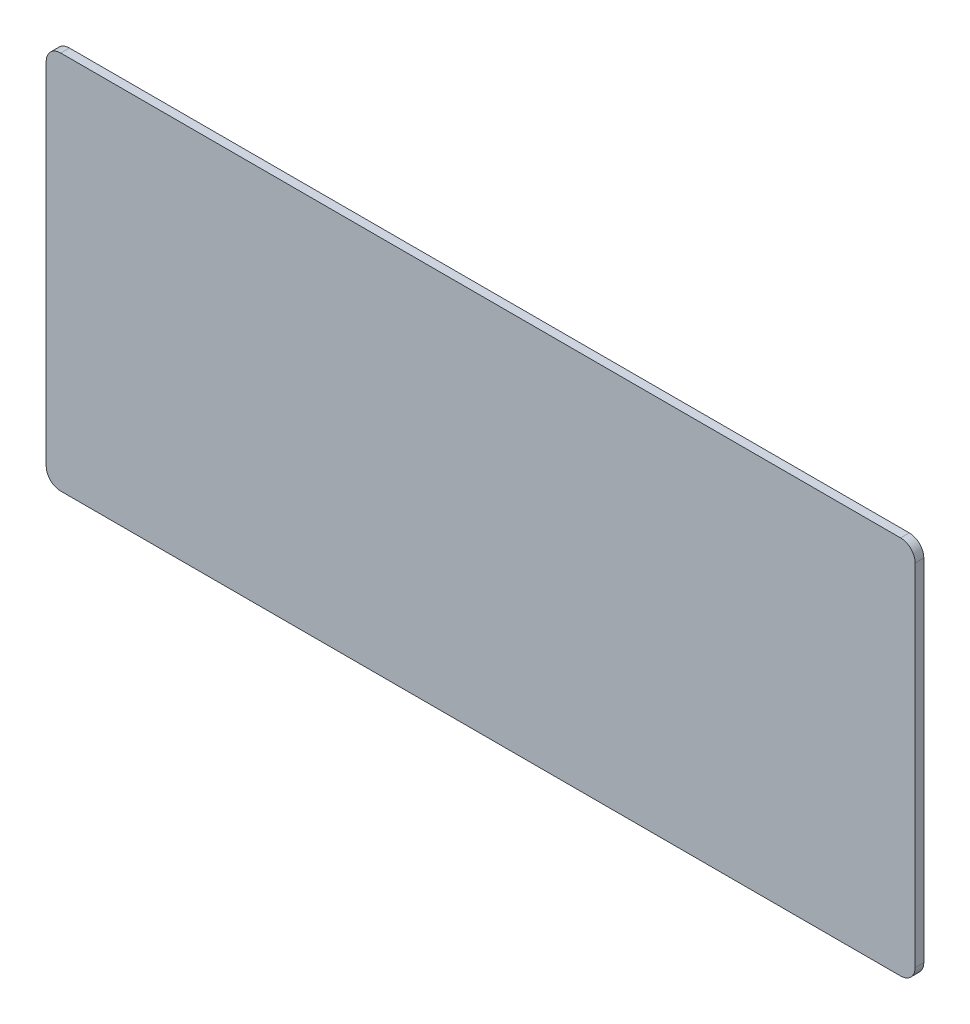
ISO-10303-21;
HEADER;
FILE_DESCRIPTION(('STEP AP214'),'2;1');
FILE_NAME('part.step','',(''),(''),'','','');
FILE_SCHEMA(('AUTOMOTIVE_DESIGN { 1 0 10303 214 1 1 1 1 }'));
ENDSEC;
DATA;
#1=APPLICATION_CONTEXT('core data for automotive mechanical design processes');
#2=APPLICATION_PROTOCOL_DEFINITION('international standard','automotive_design',2000,#1);
#3=PRODUCT_CONTEXT('',#1,'mechanical');
#4=PRODUCT('Part','Part','',(#3));
#5=PRODUCT_RELATED_PRODUCT_CATEGORY('part','',(#4));
#6=PRODUCT_DEFINITION_FORMATION('','',#4);
#7=PRODUCT_DEFINITION_CONTEXT('part definition',#1,'design');
#8=PRODUCT_DEFINITION('design','',#6,#7);
#9=PRODUCT_DEFINITION_SHAPE('','',#8);
#10=(LENGTH_UNIT() NAMED_UNIT(*) SI_UNIT(.MILLI.,.METRE.));
#11=(NAMED_UNIT(*) PLANE_ANGLE_UNIT() SI_UNIT($,.RADIAN.));
#12=(NAMED_UNIT(*) SI_UNIT($,.STERADIAN.) SOLID_ANGLE_UNIT());
#13=UNCERTAINTY_MEASURE_WITH_UNIT(LENGTH_MEASURE(1.E-05),#10,'distance_accuracy_value','');
#14=(GEOMETRIC_REPRESENTATION_CONTEXT(3) GLOBAL_UNCERTAINTY_ASSIGNED_CONTEXT((#13)) GLOBAL_UNIT_ASSIGNED_CONTEXT((#10,
#11,#12)) REPRESENTATION_CONTEXT('',''));
#15=CARTESIAN_POINT('',(0.,0.,0.));
#16=DIRECTION('',(0.,0.,1.));
#17=DIRECTION('',(1.,0.,0.));
#18=AXIS2_PLACEMENT_3D('',#15,#16,#17);
#19=CARTESIAN_POINT('',(0.,0.,6.));
#20=DIRECTION('',(1.,0.,0.));
#21=DIRECTION('',(0.,1.,0.));
#22=AXIS2_PLACEMENT_3D('',#19,#20,#21);
#23=PLANE('',#22);
#24=DIRECTION('',(0.,-1.,0.));
#25=VECTOR('',#24,1.);
#26=CARTESIAN_POINT('',(0.,0.,0.));
#27=LINE('',#26,#25);
#28=CARTESIAN_POINT('',(0.,-10.,0.));
#29=VERTEX_POINT('',#28);
#30=CARTESIAN_POINT('',(1.11910480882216E-13,-252.,0.));
#31=VERTEX_POINT('',#30);
#32=EDGE_CURVE('E136',#29,#31,#27,.T.);
#33=ORIENTED_EDGE('',*,*,#32,.T.);
#34=DIRECTION('',(0.,0.,-1.));
#35=VECTOR('',#34,1.);
#36=CARTESIAN_POINT('',(1.11910480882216E-13,-252.,6.));
#37=LINE('',#36,#35);
#38=CARTESIAN_POINT('',(1.11910480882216E-13,-252.,6.));
#39=VERTEX_POINT('',#38);
#40=EDGE_CURVE('E111',#31,#39,#37,.F.);
#41=ORIENTED_EDGE('',*,*,#40,.T.);
#42=DIRECTION('',(0.,-1.,0.));
#43=VECTOR('',#42,1.);
#44=CARTESIAN_POINT('',(0.,0.,6.));
#45=LINE('',#44,#43);
#46=CARTESIAN_POINT('',(0.,-10.,6.));
#47=VERTEX_POINT('',#46);
#48=EDGE_CURVE('E139',#47,#39,#45,.T.);
#49=ORIENTED_EDGE('',*,*,#48,.F.);
#50=DIRECTION('',(0.,0.,-1.));
#51=VECTOR('',#50,1.);
#52=CARTESIAN_POINT('',(0.,-10.,6.));
#53=LINE('',#52,#51);
#54=EDGE_CURVE('E116',#47,#29,#53,.T.);
#55=ORIENTED_EDGE('',*,*,#54,.T.);
#56=EDGE_LOOP('',(#33,#41,#49,#55));
#57=FACE_BOUND('',#56,.T.);
#58=ADVANCED_FACE('F40',(#57),#23,.F.);
#59=CARTESIAN_POINT('',(600.,0.,6.));
#60=DIRECTION('',(-1.,0.,0.));
#61=DIRECTION('',(0.,-1.,0.));
#62=AXIS2_PLACEMENT_3D('',#59,#60,#61);
#63=PLANE('',#62);
#64=DIRECTION('',(0.,1.,0.));
#65=VECTOR('',#64,1.);
#66=CARTESIAN_POINT('',(600.,0.,6.));
#67=LINE('',#66,#65);
#68=CARTESIAN_POINT('',(600.,-252.,6.));
#69=VERTEX_POINT('',#68);
#70=CARTESIAN_POINT('',(600.,-9.99999999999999,6.));
#71=VERTEX_POINT('',#70);
#72=EDGE_CURVE('E142',#69,#71,#67,.T.);
#73=ORIENTED_EDGE('',*,*,#72,.F.);
#74=DIRECTION('',(0.,0.,1.));
#75=VECTOR('',#74,1.);
#76=CARTESIAN_POINT('',(600.,-252.,0.));
#77=LINE('',#76,#75);
#78=CARTESIAN_POINT('',(600.,-252.,0.));
#79=VERTEX_POINT('',#78);
#80=EDGE_CURVE('E11',#69,#79,#77,.F.);
#81=ORIENTED_EDGE('',*,*,#80,.T.);
#82=DIRECTION('',(0.,1.,0.));
#83=VECTOR('',#82,1.);
#84=CARTESIAN_POINT('',(600.,0.,0.));
#85=LINE('',#84,#83);
#86=CARTESIAN_POINT('',(600.,-9.99999999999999,0.));
#87=VERTEX_POINT('',#86);
#88=EDGE_CURVE('E148',#79,#87,#85,.T.);
#89=ORIENTED_EDGE('',*,*,#88,.T.);
#90=DIRECTION('',(0.,0.,-1.));
#91=VECTOR('',#90,1.);
#92=CARTESIAN_POINT('',(600.,-9.99999999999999,6.));
#93=LINE('',#92,#91);
#94=EDGE_CURVE('E48',#87,#71,#93,.F.);
#95=ORIENTED_EDGE('',*,*,#94,.T.);
#96=EDGE_LOOP('',(#73,#81,#89,#95));
#97=FACE_BOUND('',#96,.T.);
#98=ADVANCED_FACE('F172',(#97),#63,.F.);
#99=CARTESIAN_POINT('',(0.,0.,6.));
#100=DIRECTION('',(0.,-1.,0.));
#101=DIRECTION('',(0.,0.,-1.));
#102=AXIS2_PLACEMENT_3D('',#99,#100,#101);
#103=PLANE('',#102);
#104=DIRECTION('',(-1.,0.,0.));
#105=VECTOR('',#104,1.);
#106=CARTESIAN_POINT('',(0.,0.,0.));
#107=LINE('',#106,#105);
#108=CARTESIAN_POINT('',(590.,0.,0.));
#109=VERTEX_POINT('',#108);
#110=CARTESIAN_POINT('',(10.,0.,0.));
#111=VERTEX_POINT('',#110);
#112=EDGE_CURVE('E143',#109,#111,#107,.T.);
#113=ORIENTED_EDGE('',*,*,#112,.T.);
#114=DIRECTION('',(0.,0.,-1.));
#115=VECTOR('',#114,1.);
#116=CARTESIAN_POINT('',(10.,0.,6.));
#117=LINE('',#116,#115);
#118=CARTESIAN_POINT('',(10.,0.,6.));
#119=VERTEX_POINT('',#118);
#120=EDGE_CURVE('E55',#111,#119,#117,.F.);
#121=ORIENTED_EDGE('',*,*,#120,.T.);
#122=DIRECTION('',(-1.,0.,0.));
#123=VECTOR('',#122,1.);
#124=CARTESIAN_POINT('',(0.,0.,6.));
#125=LINE('',#124,#123);
#126=CARTESIAN_POINT('',(590.,0.,6.));
#127=VERTEX_POINT('',#126);
#128=EDGE_CURVE('E145',#127,#119,#125,.T.);
#129=ORIENTED_EDGE('',*,*,#128,.F.);
#130=DIRECTION('',(0.,0.,-1.));
#131=VECTOR('',#130,1.);
#132=CARTESIAN_POINT('',(590.,0.,6.));
#133=LINE('',#132,#131);
#134=EDGE_CURVE('E166',#127,#109,#133,.T.);
#135=ORIENTED_EDGE('',*,*,#134,.T.);
#136=EDGE_LOOP('',(#113,#121,#129,#135));
#137=FACE_BOUND('',#136,.T.);
#138=ADVANCED_FACE('F178',(#137),#103,.F.);
#139=CARTESIAN_POINT('',(0.,0.,6.));
#140=DIRECTION('',(0.,0.,1.));
#141=DIRECTION('',(1.,0.,0.));
#142=AXIS2_PLACEMENT_3D('',#139,#140,#141);
#143=PLANE('',#142);
#144=ORIENTED_EDGE('',*,*,#48,.T.);
#145=CARTESIAN_POINT('',(10.0000000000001,-252.,6.));
#146=DIRECTION('',(0.,0.,1.));
#147=DIRECTION('',(1.,0.,0.));
#148=AXIS2_PLACEMENT_3D('',#145,#146,#147);
#149=CIRCLE('',#148,10.);
#150=CARTESIAN_POINT('',(10.0000000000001,-262.,6.));
#151=VERTEX_POINT('',#150);
#152=EDGE_CURVE('E164',#39,#151,#149,.T.);
#153=ORIENTED_EDGE('',*,*,#152,.T.);
#154=DIRECTION('',(-1.,0.,0.));
#155=VECTOR('',#154,1.);
#156=CARTESIAN_POINT('',(1.11022302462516E-13,-262.,6.));
#157=LINE('',#156,#155);
#158=CARTESIAN_POINT('',(590.,-262.,6.));
#159=VERTEX_POINT('',#158);
#160=EDGE_CURVE('E127',#159,#151,#157,.T.);
#161=ORIENTED_EDGE('',*,*,#160,.F.);
#162=CARTESIAN_POINT('',(590.,-252.,6.));
#163=DIRECTION('',(0.,0.,1.));
#164=DIRECTION('',(1.,0.,0.));
#165=AXIS2_PLACEMENT_3D('',#162,#163,#164);
#166=CIRCLE('',#165,10.);
#167=EDGE_CURVE('E160',#159,#69,#166,.T.);
#168=ORIENTED_EDGE('',*,*,#167,.T.);
#169=ORIENTED_EDGE('',*,*,#72,.T.);
#170=CARTESIAN_POINT('',(590.,-10.,6.));
#171=DIRECTION('',(0.,0.,1.));
#172=DIRECTION('',(1.,0.,0.));
#173=AXIS2_PLACEMENT_3D('',#170,#171,#172);
#174=CIRCLE('',#173,10.);
#175=EDGE_CURVE('E62',#71,#127,#174,.T.);
#176=ORIENTED_EDGE('',*,*,#175,.T.);
#177=ORIENTED_EDGE('',*,*,#128,.T.);
#178=CARTESIAN_POINT('',(10.,-10.,6.));
#179=DIRECTION('',(0.,0.,1.));
#180=DIRECTION('',(1.,0.,0.));
#181=AXIS2_PLACEMENT_3D('',#178,#179,#180);
#182=CIRCLE('',#181,10.);
#183=EDGE_CURVE('E162',#119,#47,#182,.T.);
#184=ORIENTED_EDGE('',*,*,#183,.T.);
#185=EDGE_LOOP('',(#144,#153,#161,#168,#169,#176,#177,#184));
#186=FACE_BOUND('',#185,.T.);
#187=ADVANCED_FACE('F175',(#186),#143,.T.);
#188=CARTESIAN_POINT('',(0.,0.,0.));
#189=DIRECTION('',(0.,0.,1.));
#190=DIRECTION('',(1.,0.,0.));
#191=AXIS2_PLACEMENT_3D('',#188,#189,#190);
#192=PLANE('',#191);
#193=DIRECTION('',(1.,0.,0.));
#194=VECTOR('',#193,1.);
#195=CARTESIAN_POINT('',(1.11022302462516E-13,-262.,0.));
#196=LINE('',#195,#194);
#197=CARTESIAN_POINT('',(10.0000000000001,-262.,0.));
#198=VERTEX_POINT('',#197);
#199=CARTESIAN_POINT('',(590.,-262.,0.));
#200=VERTEX_POINT('',#199);
#201=EDGE_CURVE('E124',#198,#200,#196,.T.);
#202=ORIENTED_EDGE('',*,*,#201,.F.);
#203=CARTESIAN_POINT('',(10.0000000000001,-252.,0.));
#204=DIRECTION('',(0.,0.,1.));
#205=DIRECTION('',(1.,0.,0.));
#206=AXIS2_PLACEMENT_3D('',#203,#204,#205);
#207=CIRCLE('',#206,10.);
#208=EDGE_CURVE('E106',#198,#31,#207,.F.);
#209=ORIENTED_EDGE('',*,*,#208,.T.);
#210=ORIENTED_EDGE('',*,*,#32,.F.);
#211=CARTESIAN_POINT('',(10.,-10.,0.));
#212=DIRECTION('',(0.,0.,1.));
#213=DIRECTION('',(1.,0.,0.));
#214=AXIS2_PLACEMENT_3D('',#211,#212,#213);
#215=CIRCLE('',#214,10.);
#216=EDGE_CURVE('E117',#29,#111,#215,.F.);
#217=ORIENTED_EDGE('',*,*,#216,.T.);
#218=ORIENTED_EDGE('',*,*,#112,.F.);
#219=CARTESIAN_POINT('',(590.,-10.,0.));
#220=DIRECTION('',(0.,0.,1.));
#221=DIRECTION('',(1.,0.,0.));
#222=AXIS2_PLACEMENT_3D('',#219,#220,#221);
#223=CIRCLE('',#222,10.);
#224=EDGE_CURVE('E128',#109,#87,#223,.F.);
#225=ORIENTED_EDGE('',*,*,#224,.T.);
#226=ORIENTED_EDGE('',*,*,#88,.F.);
#227=CARTESIAN_POINT('',(590.,-252.,0.));
#228=DIRECTION('',(0.,0.,1.));
#229=DIRECTION('',(1.,0.,0.));
#230=AXIS2_PLACEMENT_3D('',#227,#228,#229);
#231=CIRCLE('',#230,10.);
#232=EDGE_CURVE('E134',#79,#200,#231,.F.);
#233=ORIENTED_EDGE('',*,*,#232,.T.);
#234=EDGE_LOOP('',(#202,#209,#210,#217,#218,#225,#226,#233));
#235=FACE_BOUND('',#234,.T.);
#236=ADVANCED_FACE('F131',(#235),#192,.F.);
#237=CARTESIAN_POINT('',(0.,-262.,0.));
#238=DIRECTION('',(0.,-1.,0.));
#239=DIRECTION('',(0.,0.,-1.));
#240=AXIS2_PLACEMENT_3D('',#237,#238,#239);
#241=PLANE('',#240);
#242=ORIENTED_EDGE('',*,*,#160,.T.);
#243=DIRECTION('',(0.,0.,-1.));
#244=VECTOR('',#243,1.);
#245=CARTESIAN_POINT('',(10.0000000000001,-262.,0.));
#246=LINE('',#245,#244);
#247=EDGE_CURVE('E110',#151,#198,#246,.T.);
#248=ORIENTED_EDGE('',*,*,#247,.T.);
#249=ORIENTED_EDGE('',*,*,#201,.T.);
#250=DIRECTION('',(0.,0.,1.));
#251=VECTOR('',#250,1.);
#252=CARTESIAN_POINT('',(590.,-262.,6.));
#253=LINE('',#252,#251);
#254=EDGE_CURVE('E129',#200,#159,#253,.T.);
#255=ORIENTED_EDGE('',*,*,#254,.T.);
#256=EDGE_LOOP('',(#242,#248,#249,#255));
#257=FACE_BOUND('',#256,.T.);
#258=ADVANCED_FACE('F122',(#257),#241,.T.);
#259=CARTESIAN_POINT('',(10.0000000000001,-252.,0.));
#260=DIRECTION('',(0.,0.,1.));
#261=DIRECTION('',(1.,0.,0.));
#262=AXIS2_PLACEMENT_3D('',#259,#260,#261);
#263=CYLINDRICAL_SURFACE('',#262,10.);
#264=ORIENTED_EDGE('',*,*,#152,.F.);
#265=ORIENTED_EDGE('',*,*,#40,.F.);
#266=ORIENTED_EDGE('',*,*,#208,.F.);
#267=ORIENTED_EDGE('',*,*,#247,.F.);
#268=EDGE_LOOP('',(#264,#265,#266,#267));
#269=FACE_BOUND('',#268,.T.);
#270=ADVANCED_FACE('F109',(#269),#263,.T.);
#271=CARTESIAN_POINT('',(10.,-10.,6.));
#272=DIRECTION('',(0.,0.,-1.));
#273=DIRECTION('',(-1.,0.,0.));
#274=AXIS2_PLACEMENT_3D('',#271,#272,#273);
#275=CYLINDRICAL_SURFACE('',#274,10.);
#276=ORIENTED_EDGE('',*,*,#183,.F.);
#277=ORIENTED_EDGE('',*,*,#120,.F.);
#278=ORIENTED_EDGE('',*,*,#216,.F.);
#279=ORIENTED_EDGE('',*,*,#54,.F.);
#280=EDGE_LOOP('',(#276,#277,#278,#279));
#281=FACE_BOUND('',#280,.T.);
#282=ADVANCED_FACE('F182',(#281),#275,.T.);
#283=CARTESIAN_POINT('',(590.,-252.,0.));
#284=DIRECTION('',(0.,0.,-1.));
#285=DIRECTION('',(-1.,0.,0.));
#286=AXIS2_PLACEMENT_3D('',#283,#284,#285);
#287=CYLINDRICAL_SURFACE('',#286,10.);
#288=ORIENTED_EDGE('',*,*,#232,.F.);
#289=ORIENTED_EDGE('',*,*,#80,.F.);
#290=ORIENTED_EDGE('',*,*,#167,.F.);
#291=ORIENTED_EDGE('',*,*,#254,.F.);
#292=EDGE_LOOP('',(#288,#289,#290,#291));
#293=FACE_BOUND('',#292,.T.);
#294=ADVANCED_FACE('F196',(#293),#287,.T.);
#295=CARTESIAN_POINT('',(590.,-10.,6.));
#296=DIRECTION('',(0.,0.,-1.));
#297=DIRECTION('',(-1.,0.,0.));
#298=AXIS2_PLACEMENT_3D('',#295,#296,#297);
#299=CYLINDRICAL_SURFACE('',#298,10.);
#300=ORIENTED_EDGE('',*,*,#175,.F.);
#301=ORIENTED_EDGE('',*,*,#94,.F.);
#302=ORIENTED_EDGE('',*,*,#224,.F.);
#303=ORIENTED_EDGE('',*,*,#134,.F.);
#304=EDGE_LOOP('',(#300,#301,#302,#303));
#305=FACE_BOUND('',#304,.T.);
#306=ADVANCED_FACE('F42',(#305),#299,.T.);
#307=CLOSED_SHELL('',(#58,#98,#138,#187,#236,#258,#270,#282,#294,#306));
#308=MANIFOLD_SOLID_BREP('B2',#307);
#309=ADVANCED_BREP_SHAPE_REPRESENTATION('',(#18,#308),#14);
#310=SHAPE_DEFINITION_REPRESENTATION(#9,#309);
ENDSEC;
END-ISO-10303-21;
